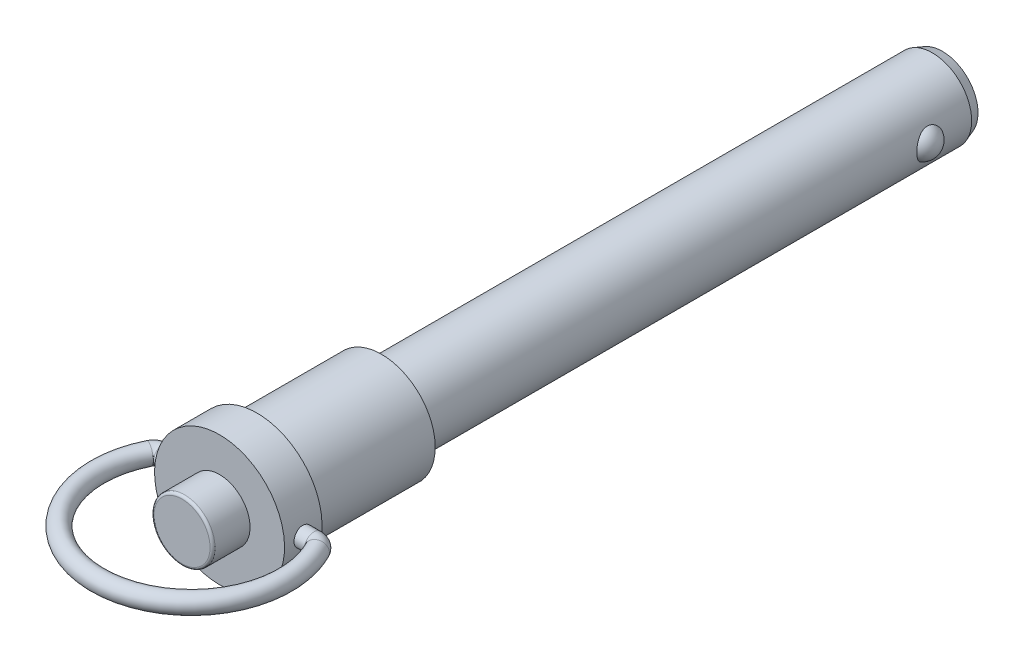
ISO-10303-21;
HEADER;
FILE_DESCRIPTION(('STEP AP214'),'2;1');
FILE_NAME('part.step','',(''),(''),'','','');
FILE_SCHEMA(('AUTOMOTIVE_DESIGN { 1 0 10303 214 1 1 1 1 }'));
ENDSEC;
DATA;
#1=APPLICATION_CONTEXT('core data for automotive mechanical design processes');
#2=APPLICATION_PROTOCOL_DEFINITION('international standard','automotive_design',2000,#1);
#3=PRODUCT_CONTEXT('',#1,'mechanical');
#4=PRODUCT('Part','Part','',(#3));
#5=PRODUCT_RELATED_PRODUCT_CATEGORY('part','',(#4));
#6=PRODUCT_DEFINITION_FORMATION('','',#4);
#7=PRODUCT_DEFINITION_CONTEXT('part definition',#1,'design');
#8=PRODUCT_DEFINITION('design','',#6,#7);
#9=PRODUCT_DEFINITION_SHAPE('','',#8);
#10=(LENGTH_UNIT() NAMED_UNIT(*) SI_UNIT(.MILLI.,.METRE.));
#11=(NAMED_UNIT(*) PLANE_ANGLE_UNIT() SI_UNIT($,.RADIAN.));
#12=(NAMED_UNIT(*) SI_UNIT($,.STERADIAN.) SOLID_ANGLE_UNIT());
#13=UNCERTAINTY_MEASURE_WITH_UNIT(LENGTH_MEASURE(1.E-05),#10,'distance_accuracy_value','');
#14=(GEOMETRIC_REPRESENTATION_CONTEXT(3) GLOBAL_UNCERTAINTY_ASSIGNED_CONTEXT((#13)) GLOBAL_UNIT_ASSIGNED_CONTEXT((#10,
#11,#12)) REPRESENTATION_CONTEXT('',''));
#15=CARTESIAN_POINT('',(0.,0.,0.));
#16=DIRECTION('',(0.,0.,1.));
#17=DIRECTION('',(1.,0.,0.));
#18=AXIS2_PLACEMENT_3D('',#15,#16,#17);
#19=CARTESIAN_POINT('',(-7.23283748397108,0.,-113.9826));
#20=DIRECTION('',(0.,0.,1.));
#21=DIRECTION('',(0.,1.,0.));
#22=AXIS2_PLACEMENT_3D('',#19,#20,#21);
#23=PLANE('',#22);
#24=CARTESIAN_POINT('',(0.,0.,-113.9826));
#25=DIRECTION('',(0.,0.,1.));
#26=DIRECTION('',(0.,1.,0.));
#27=AXIS2_PLACEMENT_3D('',#24,#25,#26);
#28=CIRCLE('',#27,7.23283748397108);
#29=CARTESIAN_POINT('',(0.,7.23283748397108,-113.9826));
#30=VERTEX_POINT('',#29);
#31=EDGE_CURVE('E210',#30,#30,#28,.T.);
#32=ORIENTED_EDGE('',*,*,#31,.F.);
#33=EDGE_LOOP('',(#32));
#34=FACE_BOUND('',#33,.T.);
#35=ADVANCED_FACE('F14',(#34),#23,.F.);
#36=CARTESIAN_POINT('',(6.3254,0.,-103.5178));
#37=DIRECTION('',(0.,0.,1.));
#38=DIRECTION('',(-1.,0.,0.));
#39=AXIS2_PLACEMENT_3D('',#36,#37,#38);
#40=SPHERICAL_SURFACE('',#39,3.175);
#41=CARTESIAN_POINT('',(7.972425,0.,-100.803406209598));
#42=CARTESIAN_POINT('',(7.97241726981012,0.174963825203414,-100.803411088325));
#43=CARTESIAN_POINT('',(7.96661031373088,0.350072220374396,-100.816853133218));
#44=CARTESIAN_POINT('',(7.94391651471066,0.695574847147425,-100.870541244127));
#45=CARTESIAN_POINT('',(7.92701418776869,0.865962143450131,-100.910824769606));
#46=CARTESIAN_POINT('',(7.88381094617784,1.19705751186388,-101.017849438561));
#47=CARTESIAN_POINT('',(7.85750751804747,1.35776298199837,-101.084597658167));
#48=CARTESIAN_POINT('',(7.79828591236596,1.66454963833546,-101.24375889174));
#49=CARTESIAN_POINT('',(7.76536929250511,1.81063425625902,-101.336165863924));
#50=CARTESIAN_POINT('',(7.6973220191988,2.08082133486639,-101.543431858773));
#51=CARTESIAN_POINT('',(7.6622476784,2.20529978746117,-101.657813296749));
#52=CARTESIAN_POINT('',(7.61082801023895,2.37452550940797,-101.845271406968));
#53=CARTESIAN_POINT('',(7.59387880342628,2.42804053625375,-101.910440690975));
#54=CARTESIAN_POINT('',(7.56094914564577,2.52871559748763,-102.045725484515));
#55=CARTESIAN_POINT('',(7.54496815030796,2.57587922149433,-102.115838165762));
#56=CARTESIAN_POINT('',(7.51569590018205,2.66002101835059,-102.255095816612));
#57=CARTESIAN_POINT('',(7.50229271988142,2.6974987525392,-102.323916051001));
#58=CARTESIAN_POINT('',(7.47725403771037,2.76614659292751,-102.46490445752));
#59=CARTESIAN_POINT('',(7.46561758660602,2.79732008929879,-102.537070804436));
#60=CARTESIAN_POINT('',(7.44451748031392,2.85299970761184,-102.684199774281));
#61=CARTESIAN_POINT('',(7.43505273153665,2.87750918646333,-102.759160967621));
#62=CARTESIAN_POINT('',(7.41863811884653,2.91956849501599,-102.911278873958));
#63=CARTESIAN_POINT('',(7.41168797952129,2.93711908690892,-102.988435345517));
#64=CARTESIAN_POINT('',(7.40116212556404,2.96353478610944,-103.13590466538));
#65=CARTESIAN_POINT('',(7.39730521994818,2.97312751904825,-103.206067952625));
#66=CARTESIAN_POINT('',(7.39192783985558,2.98647205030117,-103.347062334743));
#67=CARTESIAN_POINT('',(7.39040812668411,2.99022194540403,-103.417893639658));
#68=CARTESIAN_POINT('',(7.38975833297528,2.99182794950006,-103.559589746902));
#69=CARTESIAN_POINT('',(7.39062662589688,2.9896880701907,-103.630454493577));
#70=CARTESIAN_POINT('',(7.39471686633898,2.97955470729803,-103.771703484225));
#71=CARTESIAN_POINT('',(7.39793967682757,2.97155907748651,-103.84208754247));
#72=CARTESIAN_POINT('',(7.41052697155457,2.94009947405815,-104.043919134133));
#73=CARTESIAN_POINT('',(7.42280379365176,2.90920494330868,-104.1741115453));
#74=CARTESIAN_POINT('',(7.45413145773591,2.82795803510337,-104.427305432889));
#75=CARTESIAN_POINT('',(7.47318306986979,2.77760344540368,-104.550306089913));
#76=CARTESIAN_POINT('',(7.51696016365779,2.65690222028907,-104.790970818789));
#77=CARTESIAN_POINT('',(7.5418730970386,2.58587106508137,-104.908256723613));
#78=CARTESIAN_POINT('',(7.59450635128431,2.42693839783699,-105.130031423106));
#79=CARTESIAN_POINT('',(7.62222751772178,2.33903179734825,-105.234516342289));
#80=CARTESIAN_POINT('',(7.68069620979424,2.13967899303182,-105.438398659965));
#81=CARTESIAN_POINT('',(7.71148158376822,2.02679150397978,-105.53637565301));
#82=CARTESIAN_POINT('',(7.77061509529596,1.78672707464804,-105.71388153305));
#83=CARTESIAN_POINT('',(7.79896157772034,1.65954056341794,-105.793397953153));
#84=CARTESIAN_POINT('',(7.85313577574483,1.38188004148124,-105.939506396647));
#85=CARTESIAN_POINT('',(7.87849512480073,1.23034006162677,-106.004248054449));
#86=CARTESIAN_POINT('',(7.92093083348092,0.918236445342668,-106.109961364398));
#87=CARTESIAN_POINT('',(7.9380155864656,0.757682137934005,-106.150957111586));
#88=CARTESIAN_POINT('',(7.95754077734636,0.496793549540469,-106.197335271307));
#89=CARTESIAN_POINT('',(7.96310427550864,0.39798439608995,-106.210400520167));
#90=CARTESIAN_POINT('',(7.97054862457,0.199465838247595,-106.227831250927));
#91=CARTESIAN_POINT('',(7.97242940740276,0.0997564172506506,-106.232196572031));
#92=CARTESIAN_POINT('',(7.97241726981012,-0.174963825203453,-106.232188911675));
#93=CARTESIAN_POINT('',(7.96661031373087,-0.350072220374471,-106.218746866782));
#94=CARTESIAN_POINT('',(7.94391651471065,-0.695574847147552,-106.165058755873));
#95=CARTESIAN_POINT('',(7.92701418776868,-0.865962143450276,-106.124775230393));
#96=CARTESIAN_POINT('',(7.88381094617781,-1.19705751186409,-106.017750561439));
#97=CARTESIAN_POINT('',(7.85750751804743,-1.35776298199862,-105.951002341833));
#98=CARTESIAN_POINT('',(7.7982859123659,-1.66454963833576,-105.79184110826));
#99=CARTESIAN_POINT('',(7.76536929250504,-1.81063425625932,-105.699434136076));
#100=CARTESIAN_POINT('',(7.69732201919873,-2.08082133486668,-105.492168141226));
#101=CARTESIAN_POINT('',(7.66224767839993,-2.20529978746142,-105.377786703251));
#102=CARTESIAN_POINT('',(7.61082801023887,-2.37452550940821,-105.190328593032));
#103=CARTESIAN_POINT('',(7.59387880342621,-2.428040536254,-105.125159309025));
#104=CARTESIAN_POINT('',(7.5609491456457,-2.52871559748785,-104.989874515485));
#105=CARTESIAN_POINT('',(7.54496815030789,-2.57587922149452,-104.919761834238));
#106=CARTESIAN_POINT('',(7.51569590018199,-2.66002101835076,-104.780504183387));
#107=CARTESIAN_POINT('',(7.50229271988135,-2.69749875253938,-104.711683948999));
#108=CARTESIAN_POINT('',(7.47725403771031,-2.76614659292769,-104.57069554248));
#109=CARTESIAN_POINT('',(7.46561758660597,-2.79732008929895,-104.498529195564));
#110=CARTESIAN_POINT('',(7.44451748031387,-2.85299970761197,-104.351400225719));
#111=CARTESIAN_POINT('',(7.4350527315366,-2.87750918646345,-104.276439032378));
#112=CARTESIAN_POINT('',(7.4186381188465,-2.91956849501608,-104.124321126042));
#113=CARTESIAN_POINT('',(7.41168797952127,-2.93711908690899,-104.047164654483));
#114=CARTESIAN_POINT('',(7.40116212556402,-2.96353478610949,-103.89969533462));
#115=CARTESIAN_POINT('',(7.39730521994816,-2.97312751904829,-103.829532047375));
#116=CARTESIAN_POINT('',(7.39192783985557,-2.9864720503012,-103.688537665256));
#117=CARTESIAN_POINT('',(7.3904081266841,-2.99022194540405,-103.617706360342));
#118=CARTESIAN_POINT('',(7.38975833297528,-2.99182794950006,-103.476010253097));
#119=CARTESIAN_POINT('',(7.39062662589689,-2.98968807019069,-103.405145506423));
#120=CARTESIAN_POINT('',(7.39471686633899,-2.979554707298,-103.263896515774));
#121=CARTESIAN_POINT('',(7.39793967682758,-2.97155907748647,-103.193512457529));
#122=CARTESIAN_POINT('',(7.41052697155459,-2.9400994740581,-102.991680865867));
#123=CARTESIAN_POINT('',(7.42280379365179,-2.90920494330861,-102.8614884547));
#124=CARTESIAN_POINT('',(7.45413145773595,-2.82795803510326,-102.608294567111));
#125=CARTESIAN_POINT('',(7.47318306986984,-2.77760344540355,-102.485293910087));
#126=CARTESIAN_POINT('',(7.51696016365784,-2.65690222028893,-102.24462918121));
#127=CARTESIAN_POINT('',(7.54187309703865,-2.58587106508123,-102.127343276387));
#128=CARTESIAN_POINT('',(7.59450635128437,-2.42693839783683,-101.905568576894));
#129=CARTESIAN_POINT('',(7.62222751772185,-2.33903179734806,-101.801083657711));
#130=CARTESIAN_POINT('',(7.68069620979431,-2.13967899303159,-101.597201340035));
#131=CARTESIAN_POINT('',(7.71148158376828,-2.02679150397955,-101.49922434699));
#132=CARTESIAN_POINT('',(7.77061509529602,-1.78672707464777,-101.32171846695));
#133=CARTESIAN_POINT('',(7.7989615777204,-1.65954056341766,-101.242202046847));
#134=CARTESIAN_POINT('',(7.85313577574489,-1.38188004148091,-101.096093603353));
#135=CARTESIAN_POINT('',(7.87849512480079,-1.23034006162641,-101.031351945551));
#136=CARTESIAN_POINT('',(7.92093083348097,-0.918236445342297,-100.925638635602));
#137=CARTESIAN_POINT('',(7.93801558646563,-0.757682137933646,-100.884642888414));
#138=CARTESIAN_POINT('',(7.95754077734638,-0.496793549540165,-100.838264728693));
#139=CARTESIAN_POINT('',(7.96310427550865,-0.397984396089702,-100.825199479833));
#140=CARTESIAN_POINT('',(7.97054862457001,-0.199465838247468,-100.807768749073));
#141=CARTESIAN_POINT('',(7.97242940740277,-0.0997564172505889,-100.803403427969));
#142=CARTESIAN_POINT('',(7.972425,0.,-100.803406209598));
#143=B_SPLINE_CURVE_WITH_KNOTS('',3,(#41,#42,#43,#44,#45,#46,#47,#48,#49,#50,#51,#52,#53,#54,
#55,#56,#57,#58,#59,#60,#61,#62,#63,#64,#65,#66,#67,#68,#69,#70,#71,#72,#73,#74,#75,#76,#77,#78,
#79,#80,#81,#82,#83,#84,#85,#86,#87,#88,#89,#90,#91,#92,#93,#94,#95,#96,#97,#98,#99,#100,#101,
#102,#103,#104,#105,#106,#107,#108,#109,#110,#111,#112,#113,#114,#115,#116,#117,#118,#119,#120,
#121,#122,#123,#124,#125,#126,#127,#128,#129,#130,#131,#132,#133,#134,#135,#136,#137,#138,#139,
#140,#141,#142),.UNSPECIFIED.,.T.,.F.,(4,2,2,2,2,2,2,2,2,2,2,2,2,2,2,2,2,2,2,2,2,2,2,2,2,2,2,2,
2,2,2,2,2,2,2,2,2,2,2,2,2,2,2,2,2,2,2,2,2,2,4),(0.,0.52453249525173,1.04979855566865,
1.57520515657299,2.10048814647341,2.61543479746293,2.87315909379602,3.13073711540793,
3.36891793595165,3.60697032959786,3.84490258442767,4.08280877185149,4.29529683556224,
4.5078540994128,4.72026662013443,4.93275703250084,5.33386765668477,5.73502389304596,
6.15136290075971,6.56782764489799,7.02375816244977,7.47999569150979,7.97801301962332,
8.47552411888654,8.77458316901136,9.07364774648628,9.59818024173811,10.1234463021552,
10.6488529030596,11.17413589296,11.6890825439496,11.9468068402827,12.2043848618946,
12.4425656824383,12.6806180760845,12.9185503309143,13.1564565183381,13.3689445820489,
13.5815018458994,13.7939143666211,14.0064047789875,14.4075154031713,14.8086716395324,
15.2250106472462,15.6414753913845,16.0974059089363,16.5536434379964,17.05166076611,
17.5491718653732,17.8482309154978,18.1472954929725),.UNSPECIFIED.);
#144=CARTESIAN_POINT('',(7.972425,0.,-100.803406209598));
#145=VERTEX_POINT('',#144);
#146=EDGE_CURVE('E170',#145,#145,#143,.T.);
#147=ORIENTED_EDGE('',*,*,#146,.F.);
#148=EDGE_LOOP('',(#147));
#149=FACE_BOUND('',#148,.T.);
#150=ADVANCED_FACE('F143',(#149),#40,.T.);
#151=CARTESIAN_POINT('',(-6.3246,0.,-103.5178));
#152=DIRECTION('',(0.,0.,1.));
#153=DIRECTION('',(-1.,0.,0.));
#154=AXIS2_PLACEMENT_3D('',#151,#152,#153);
#155=SPHERICAL_SURFACE('',#154,3.175);
#156=CARTESIAN_POINT('',(-7.972425,0.,-106.23170820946));
#157=CARTESIAN_POINT('',(-7.97241727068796,0.174952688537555,-106.231703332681));
#158=CARTESIAN_POINT('',(-7.96661105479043,0.350049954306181,-106.218262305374));
#159=CARTESIAN_POINT('',(-7.94392013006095,0.695530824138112,-106.164578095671));
#160=CARTESIAN_POINT('',(-7.92701993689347,0.865907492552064,-106.124297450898));
#161=CARTESIAN_POINT('',(-7.88382210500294,1.19698257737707,-106.017279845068));
#162=CARTESIAN_POINT('',(-7.85752194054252,1.357678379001,-105.950535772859));
#163=CARTESIAN_POINT('',(-7.79830777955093,1.66444625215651,-105.791383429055));
#164=CARTESIAN_POINT('',(-7.76539534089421,1.81052175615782,-105.698981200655));
#165=CARTESIAN_POINT('',(-7.69735815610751,2.08068673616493,-105.491727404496));
#166=CARTESIAN_POINT('',(-7.66228978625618,2.20515274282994,-105.377354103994));
#167=CARTESIAN_POINT('',(-7.61087967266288,2.37435974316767,-105.189908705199));
#168=CARTESIAN_POINT('',(-7.593933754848,2.42786851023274,-105.124743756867));
#169=CARTESIAN_POINT('',(-7.56101087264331,2.52853087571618,-104.989467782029));
#170=CARTESIAN_POINT('',(-7.54503336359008,2.57568806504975,-104.919359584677));
#171=CARTESIAN_POINT('',(-7.51576908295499,2.65981407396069,-104.780115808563));
#172=CARTESIAN_POINT('',(-7.5023702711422,2.69728292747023,-104.711305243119));
#173=CARTESIAN_POINT('',(-7.47734019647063,2.7659135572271,-104.570336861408));
#174=CARTESIAN_POINT('',(-7.46570798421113,2.79707872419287,-104.498180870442));
#175=CARTESIAN_POINT('',(-7.44461613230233,2.85274218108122,-104.351073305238));
#176=CARTESIAN_POINT('',(-7.43515539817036,2.87724383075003,-104.276123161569));
#177=CARTESIAN_POINT('',(-7.41874848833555,2.91928796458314,-104.124028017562));
#178=CARTESIAN_POINT('',(-7.41180203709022,2.93683121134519,-104.046883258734));
#179=CARTESIAN_POINT('',(-7.40128307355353,2.96323267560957,-103.899441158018));
#180=CARTESIAN_POINT('',(-7.39742927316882,2.97281883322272,-103.829293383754));
#181=CARTESIAN_POINT('',(-7.3920573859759,2.98615137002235,-103.688330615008));
#182=CARTESIAN_POINT('',(-7.39054006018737,2.98989584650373,-103.617515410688));
#183=CARTESIAN_POINT('',(-7.38989424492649,2.99149222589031,-103.47585196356));
#184=CARTESIAN_POINT('',(-7.39076412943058,2.98934813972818,-103.405003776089));
#185=CARTESIAN_POINT('',(-7.39485671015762,2.97920762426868,-103.263788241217));
#186=CARTESIAN_POINT('',(-7.39808026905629,2.97120904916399,-103.193421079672));
#187=CARTESIAN_POINT('',(-7.41066840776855,2.9397429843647,-102.991639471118));
#188=CARTESIAN_POINT('',(-7.42294415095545,2.9088467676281,-102.86148039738));
#189=CARTESIAN_POINT('',(-7.45426659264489,2.82760178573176,-102.608352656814));
#190=CARTESIAN_POINT('',(-7.47331406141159,2.77725080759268,-102.485384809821));
#191=CARTESIAN_POINT('',(-7.51708080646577,2.6565607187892,-102.244781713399));
#192=CARTESIAN_POINT('',(-7.5419875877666,2.58553675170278,-102.127524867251));
#193=CARTESIAN_POINT('',(-7.59460690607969,2.42662332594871,-101.905805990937));
#194=CARTESIAN_POINT('',(-7.62232028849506,2.33872877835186,-101.80134783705));
#195=CARTESIAN_POINT('',(-7.68077324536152,2.13940178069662,-101.597513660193));
#196=CARTESIAN_POINT('',(-7.71155061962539,2.02652778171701,-101.499558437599));
#197=CARTESIAN_POINT('',(-7.77066832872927,1.78649437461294,-101.322092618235));
#198=CARTESIAN_POINT('',(-7.79900700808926,1.65932539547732,-101.242594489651));
#199=CARTESIAN_POINT('',(-7.85316757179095,1.38169777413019,-101.096515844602));
#200=CARTESIAN_POINT('',(-7.87852090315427,1.23017281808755,-101.031786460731));
#201=CARTESIAN_POINT('',(-7.92094613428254,0.91810159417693,-100.926094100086));
#202=CARTESIAN_POINT('',(-7.93802642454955,0.757564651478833,-100.885107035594));
#203=CARTESIAN_POINT('',(-7.95754577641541,0.496710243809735,-100.838740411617));
#204=CARTESIAN_POINT('',(-7.96310740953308,0.397917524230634,-100.825678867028));
#205=CARTESIAN_POINT('',(-7.97054925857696,0.199432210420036,-100.808253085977));
#206=CARTESIAN_POINT('',(-7.97242940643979,0.0997395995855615,-100.803889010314));
#207=CARTESIAN_POINT('',(-7.97241727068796,-0.17495268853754,-100.803896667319));
#208=CARTESIAN_POINT('',(-7.96661105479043,-0.350049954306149,-100.817337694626));
#209=CARTESIAN_POINT('',(-7.94392013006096,-0.695530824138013,-100.871021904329));
#210=CARTESIAN_POINT('',(-7.92701993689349,-0.865907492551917,-100.911302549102));
#211=CARTESIAN_POINT('',(-7.88382210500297,-1.1969825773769,-101.018320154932));
#212=CARTESIAN_POINT('',(-7.85752194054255,-1.35767837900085,-101.085064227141));
#213=CARTESIAN_POINT('',(-7.79830777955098,-1.66444625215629,-101.244216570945));
#214=CARTESIAN_POINT('',(-7.76539534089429,-1.81052175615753,-101.336618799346));
#215=CARTESIAN_POINT('',(-7.6973581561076,-2.08068673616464,-101.543872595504));
#216=CARTESIAN_POINT('',(-7.66228978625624,-2.20515274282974,-101.658245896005));
#217=CARTESIAN_POINT('',(-7.61087967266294,-2.37435974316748,-101.845691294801));
#218=CARTESIAN_POINT('',(-7.59393375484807,-2.42786851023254,-101.910856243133));
#219=CARTESIAN_POINT('',(-7.56101087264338,-2.52853087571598,-102.04613221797));
#220=CARTESIAN_POINT('',(-7.54503336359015,-2.57568806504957,-102.116240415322));
#221=CARTESIAN_POINT('',(-7.51576908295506,-2.65981407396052,-102.255484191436));
#222=CARTESIAN_POINT('',(-7.50237027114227,-2.69728292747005,-102.324294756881));
#223=CARTESIAN_POINT('',(-7.4773401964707,-2.76591355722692,-102.465263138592));
#224=CARTESIAN_POINT('',(-7.4657079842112,-2.79707872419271,-102.537419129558));
#225=CARTESIAN_POINT('',(-7.44461613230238,-2.85274218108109,-102.684526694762));
#226=CARTESIAN_POINT('',(-7.4351553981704,-2.87724383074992,-102.759476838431));
#227=CARTESIAN_POINT('',(-7.41874848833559,-2.91928796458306,-102.911571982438));
#228=CARTESIAN_POINT('',(-7.41180203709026,-2.93683121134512,-102.988716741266));
#229=CARTESIAN_POINT('',(-7.40128307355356,-2.96323267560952,-103.136158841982));
#230=CARTESIAN_POINT('',(-7.39742927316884,-2.97281883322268,-103.206306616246));
#231=CARTESIAN_POINT('',(-7.3920573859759,-2.98615137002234,-103.347269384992));
#232=CARTESIAN_POINT('',(-7.39054006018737,-2.98989584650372,-103.418084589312));
#233=CARTESIAN_POINT('',(-7.38989424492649,-2.99149222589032,-103.55974803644));
#234=CARTESIAN_POINT('',(-7.39076412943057,-2.98934813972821,-103.630596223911));
#235=CARTESIAN_POINT('',(-7.39485671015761,-2.97920762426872,-103.771811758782));
#236=CARTESIAN_POINT('',(-7.39808026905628,-2.97120904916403,-103.842178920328));
#237=CARTESIAN_POINT('',(-7.41066840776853,-2.93974298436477,-104.043960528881));
#238=CARTESIAN_POINT('',(-7.42294415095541,-2.90884676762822,-104.174119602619));
#239=CARTESIAN_POINT('',(-7.45426659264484,-2.82760178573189,-104.427247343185));
#240=CARTESIAN_POINT('',(-7.47331406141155,-2.7772508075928,-104.550215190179));
#241=CARTESIAN_POINT('',(-7.51708080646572,-2.65656071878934,-104.7908182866));
#242=CARTESIAN_POINT('',(-7.54198758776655,-2.58553675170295,-104.908075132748));
#243=CARTESIAN_POINT('',(-7.59460690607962,-2.42662332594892,-105.129794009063));
#244=CARTESIAN_POINT('',(-7.62232028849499,-2.33872877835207,-105.23425216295));
#245=CARTESIAN_POINT('',(-7.68077324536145,-2.13940178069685,-105.438086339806));
#246=CARTESIAN_POINT('',(-7.71155061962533,-2.02652778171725,-105.5360415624));
#247=CARTESIAN_POINT('',(-7.77066832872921,-1.78649437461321,-105.713507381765));
#248=CARTESIAN_POINT('',(-7.7990070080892,-1.6593253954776,-105.793005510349));
#249=CARTESIAN_POINT('',(-7.85316757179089,-1.38169777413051,-105.939084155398));
#250=CARTESIAN_POINT('',(-7.87852090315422,-1.2301728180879,-106.003813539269));
#251=CARTESIAN_POINT('',(-7.9209461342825,-0.9181015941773,-106.109505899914));
#252=CARTESIAN_POINT('',(-7.93802642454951,-0.757564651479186,-106.150492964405));
#253=CARTESIAN_POINT('',(-7.95754577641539,-0.49671024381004,-106.196859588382));
#254=CARTESIAN_POINT('',(-7.96310740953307,-0.397917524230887,-106.209921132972));
#255=CARTESIAN_POINT('',(-7.97054925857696,-0.199432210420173,-106.227346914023));
#256=CARTESIAN_POINT('',(-7.97242940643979,-0.0997395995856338,-106.231710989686));
#257=CARTESIAN_POINT('',(-7.972425,0.,-106.23170820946));
#258=B_SPLINE_CURVE_WITH_KNOTS('',3,(#156,#157,#158,#159,#160,#161,#162,#163,#164,#165,#166,
#167,#168,#169,#170,#171,#172,#173,#174,#175,#176,#177,#178,#179,#180,#181,#182,#183,#184,#185,
#186,#187,#188,#189,#190,#191,#192,#193,#194,#195,#196,#197,#198,#199,#200,#201,#202,#203,#204,
#205,#206,#207,#208,#209,#210,#211,#212,#213,#214,#215,#216,#217,#218,#219,#220,#221,#222,#223,
#224,#225,#226,#227,#228,#229,#230,#231,#232,#233,#234,#235,#236,#237,#238,#239,#240,#241,#242,
#243,#244,#245,#246,#247,#248,#249,#250,#251,#252,#253,#254,#255,#256,#257),.UNSPECIFIED.,.T.,
.F.,(4,2,2,2,2,2,2,2,2,2,2,2,2,2,2,2,2,2,2,2,2,2,2,2,2,2,2,2,2,2,2,2,2,2,2,2,2,2,2,2,2,2,2,2,2,
2,2,2,2,2,4),(0.,0.524499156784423,1.04973194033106,1.57510595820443,2.10035634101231,
2.61525617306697,2.87295695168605,3.13051142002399,3.36865238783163,3.60666491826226,
3.84455721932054,4.08242344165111,4.2948623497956,4.50737043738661,4.71973381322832,
4.93217506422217,5.33319020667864,5.73425097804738,6.15050279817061,6.56688037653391,
7.02273464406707,7.47889596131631,7.97685568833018,8.47430932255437,8.77331798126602,
9.0723321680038,9.59683132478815,10.1220641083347,10.647438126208,11.1726885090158,
11.6875883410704,11.9452891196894,12.2028435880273,12.440984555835,12.6789970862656,
12.9168893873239,13.1547556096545,13.367194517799,13.57970260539,13.7920659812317,
14.0045072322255,14.405522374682,14.8065831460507,15.222834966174,15.6392125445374,
16.0950668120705,16.5512281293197,17.0491878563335,17.5466414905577,17.8456501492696,
18.1446643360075),.UNSPECIFIED.);
#259=CARTESIAN_POINT('',(-7.972425,0.,-106.23170820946));
#260=VERTEX_POINT('',#259);
#261=EDGE_CURVE('E25',#260,#260,#258,.T.);
#262=ORIENTED_EDGE('',*,*,#261,.F.);
#263=EDGE_LOOP('',(#262));
#264=FACE_BOUND('',#263,.T.);
#265=ADVANCED_FACE('F149',(#264),#155,.T.);
#266=CARTESIAN_POINT('',(0.,0.,-111.9506));
#267=DIRECTION('',(0.,0.,1.));
#268=DIRECTION('',(0.,1.,0.));
#269=AXIS2_PLACEMENT_3D('',#266,#267,#268);
#270=CONICAL_SURFACE('',#269,7.972425,0.349065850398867);
#271=CARTESIAN_POINT('',(0.,0.,-111.9506));
#272=DIRECTION('',(0.,0.,1.));
#273=DIRECTION('',(0.,1.,0.));
#274=AXIS2_PLACEMENT_3D('',#271,#272,#273);
#275=CIRCLE('',#274,7.972425);
#276=CARTESIAN_POINT('',(0.,7.972425,-111.9506));
#277=VERTEX_POINT('',#276);
#278=EDGE_CURVE('E9',#277,#277,#275,.T.);
#279=ORIENTED_EDGE('',*,*,#278,.F.);
#280=EDGE_LOOP('',(#279));
#281=FACE_BOUND('',#280,.T.);
#282=ORIENTED_EDGE('',*,*,#31,.T.);
#283=EDGE_LOOP('',(#282));
#284=FACE_BOUND('',#283,.T.);
#285=ADVANCED_FACE('F177',(#281,#284),#270,.T.);
#286=CARTESIAN_POINT('',(0.,0.,-50.));
#287=DIRECTION('',(0.,0.,1.));
#288=DIRECTION('',(0.810321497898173,0.585985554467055,0.));
#289=AXIS2_PLACEMENT_3D('',#286,#287,#288);
#290=CYLINDRICAL_SURFACE('',#289,7.972425);
#291=CARTESIAN_POINT('',(0.,0.,0.));
#292=DIRECTION('',(0.,0.,-1.));
#293=DIRECTION('',(0.,1.,0.));
#294=AXIS2_PLACEMENT_3D('',#291,#292,#293);
#295=CIRCLE('',#294,7.972425);
#296=CARTESIAN_POINT('',(0.,7.972425,0.));
#297=VERTEX_POINT('',#296);
#298=EDGE_CURVE('E162',#297,#297,#295,.T.);
#299=ORIENTED_EDGE('',*,*,#298,.T.);
#300=EDGE_LOOP('',(#299));
#301=FACE_BOUND('',#300,.T.);
#302=ORIENTED_EDGE('',*,*,#278,.T.);
#303=EDGE_LOOP('',(#302));
#304=FACE_BOUND('',#303,.T.);
#305=ORIENTED_EDGE('',*,*,#261,.T.);
#306=EDGE_LOOP('',(#305));
#307=FACE_BOUND('',#306,.T.);
#308=ORIENTED_EDGE('',*,*,#146,.T.);
#309=EDGE_LOOP('',(#308));
#310=FACE_BOUND('',#309,.T.);
#311=ADVANCED_FACE('F63',(#301,#304,#307,#310),#290,.T.);
#312=CARTESIAN_POINT('',(0.,0.,40.545));
#313=DIRECTION('',(0.,0.,1.));
#314=DIRECTION('',(0.,1.,0.));
#315=AXIS2_PLACEMENT_3D('',#312,#313,#314);
#316=PLANE('',#315);
#317=CARTESIAN_POINT('',(0.,0.,40.545));
#318=DIRECTION('',(0.,0.,-1.));
#319=DIRECTION('',(0.,-1.,0.));
#320=AXIS2_PLACEMENT_3D('',#317,#318,#319);
#321=CIRCLE('',#320,5.6896);
#322=CARTESIAN_POINT('',(0.,-5.6896,40.545));
#323=VERTEX_POINT('',#322);
#324=CARTESIAN_POINT('',(0.,5.6896,40.545));
#325=VERTEX_POINT('',#324);
#326=EDGE_CURVE('E38',#323,#325,#321,.T.);
#327=ORIENTED_EDGE('',*,*,#326,.F.);
#328=CARTESIAN_POINT('',(0.,0.,40.545));
#329=DIRECTION('',(0.,0.,-1.));
#330=DIRECTION('',(0.,1.,0.));
#331=AXIS2_PLACEMENT_3D('',#328,#329,#330);
#332=CIRCLE('',#331,5.6896);
#333=EDGE_CURVE('E32',#325,#323,#332,.T.);
#334=ORIENTED_EDGE('',*,*,#333,.F.);
#335=EDGE_LOOP('',(#327,#334));
#336=FACE_BOUND('',#335,.T.);
#337=ADVANCED_FACE('F43',(#336),#316,.T.);
#338=CARTESIAN_POINT('',(0.,0.,38.64));
#339=DIRECTION('',(0.,1.,0.));
#340=DIRECTION('',(-1.,0.,0.));
#341=AXIS2_PLACEMENT_3D('',#338,#339,#340);
#342=TOROIDAL_SURFACE('',#341,19.05,1.8796);
#343=CARTESIAN_POINT('',(-17.0651122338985,0.,30.1733333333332));
#344=DIRECTION('',(-0.44444444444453,0.,0.895806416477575));
#345=DIRECTION('',(-0.895806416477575,0.,-0.44444444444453));
#346=AXIS2_PLACEMENT_3D('',#343,#344,#345);
#347=CIRCLE('',#346,1.8796);
#348=CARTESIAN_POINT('',(-18.7488699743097,0.,29.3379555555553));
#349=VERTEX_POINT('',#348);
#350=EDGE_CURVE('E108',#349,#349,#347,.F.);
#351=ORIENTED_EDGE('',*,*,#350,.F.);
#352=EDGE_LOOP('',(#351));
#353=FACE_BOUND('',#352,.T.);
#354=CARTESIAN_POINT('',(17.0651122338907,0.,30.1733333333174));
#355=DIRECTION('',(-0.444444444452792,0.,-0.895806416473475));
#356=DIRECTION('',(0.895806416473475,0.,-0.444444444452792));
#357=AXIS2_PLACEMENT_3D('',#354,#355,#356);
#358=CIRCLE('',#357,1.8796);
#359=CARTESIAN_POINT('',(18.7488699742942,0.,29.3379555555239));
#360=VERTEX_POINT('',#359);
#361=EDGE_CURVE('E105',#360,#360,#358,.T.);
#362=ORIENTED_EDGE('',*,*,#361,.F.);
#363=EDGE_LOOP('',(#362));
#364=FACE_BOUND('',#363,.T.);
#365=ADVANCED_FACE('F62',(#353,#364),#342,.T.);
#366=CARTESIAN_POINT('',(0.,0.,40.037));
#367=DIRECTION('',(0.,0.,1.));
#368=DIRECTION('',(0.,1.,0.));
#369=AXIS2_PLACEMENT_3D('',#366,#367,#368);
#370=TOROIDAL_SURFACE('',#369,5.6896,0.508);
#371=ORIENTED_EDGE('',*,*,#333,.T.);
#372=ORIENTED_EDGE('',*,*,#326,.T.);
#373=EDGE_LOOP('',(#371,#372));
#374=FACE_BOUND('',#373,.T.);
#375=CARTESIAN_POINT('',(0.,0.,40.037));
#376=DIRECTION('',(0.,0.,-1.));
#377=DIRECTION('',(0.,-1.,0.));
#378=AXIS2_PLACEMENT_3D('',#375,#376,#377);
#379=CIRCLE('',#378,6.1976);
#380=CARTESIAN_POINT('',(0.,-6.1976,40.037));
#381=VERTEX_POINT('',#380);
#382=EDGE_CURVE('E82',#381,#381,#379,.T.);
#383=ORIENTED_EDGE('',*,*,#382,.F.);
#384=EDGE_LOOP('',(#383));
#385=FACE_BOUND('',#384,.T.);
#386=ADVANCED_FACE('F36',(#374,#385),#370,.T.);
#387=CARTESIAN_POINT('',(-15.3586010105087,0.,31.02));
#388=DIRECTION('',(0.,1.,0.));
#389=DIRECTION('',(-1.,0.,0.));
#390=AXIS2_PLACEMENT_3D('',#387,#388,#389);
#391=TOROIDAL_SURFACE('',#390,1.905,1.8796);
#392=CARTESIAN_POINT('',(-15.3586010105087,0.,29.115));
#393=DIRECTION('',(1.,0.,0.));
#394=DIRECTION('',(0.,0.,-1.));
#395=AXIS2_PLACEMENT_3D('',#392,#393,#394);
#396=CIRCLE('',#395,1.8796);
#397=CARTESIAN_POINT('',(-15.3586010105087,0.,27.2354));
#398=VERTEX_POINT('',#397);
#399=EDGE_CURVE('E40',#398,#398,#396,.T.);
#400=ORIENTED_EDGE('',*,*,#399,.F.);
#401=EDGE_LOOP('',(#400));
#402=FACE_BOUND('',#401,.T.);
#403=ORIENTED_EDGE('',*,*,#350,.T.);
#404=EDGE_LOOP('',(#403));
#405=FACE_BOUND('',#404,.T.);
#406=ADVANCED_FACE('F65',(#402,#405),#391,.T.);
#407=CARTESIAN_POINT('',(15.3586010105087,0.,31.02));
#408=DIRECTION('',(0.,1.,0.));
#409=DIRECTION('',(-1.,0.,0.));
#410=AXIS2_PLACEMENT_3D('',#407,#408,#409);
#411=TOROIDAL_SURFACE('',#410,1.90500000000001,1.8796);
#412=CARTESIAN_POINT('',(15.3586010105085,0.,29.115));
#413=DIRECTION('',(1.,0.,0.));
#414=DIRECTION('',(0.,0.,-1.));
#415=AXIS2_PLACEMENT_3D('',#412,#413,#414);
#416=CIRCLE('',#415,1.8796);
#417=CARTESIAN_POINT('',(15.3586010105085,0.,27.2354));
#418=VERTEX_POINT('',#417);
#419=EDGE_CURVE('E44',#418,#418,#416,.F.);
#420=ORIENTED_EDGE('',*,*,#419,.F.);
#421=EDGE_LOOP('',(#420));
#422=FACE_BOUND('',#421,.T.);
#423=ORIENTED_EDGE('',*,*,#361,.T.);
#424=EDGE_LOOP('',(#423));
#425=FACE_BOUND('',#424,.T.);
#426=ADVANCED_FACE('F67',(#422,#425),#411,.T.);
#427=CARTESIAN_POINT('',(0.,0.,40.545));
#428=DIRECTION('',(0.,0.,-1.));
#429=DIRECTION('',(0.,-1.,0.));
#430=AXIS2_PLACEMENT_3D('',#427,#428,#429);
#431=CYLINDRICAL_SURFACE('',#430,6.1976);
#432=CARTESIAN_POINT('',(0.,0.,32.925));
#433=DIRECTION('',(0.,0.,-1.));
#434=DIRECTION('',(0.,-1.,0.));
#435=AXIS2_PLACEMENT_3D('',#432,#433,#434);
#436=CIRCLE('',#435,6.1976);
#437=CARTESIAN_POINT('',(0.,-6.1976,32.925));
#438=VERTEX_POINT('',#437);
#439=EDGE_CURVE('E118',#438,#438,#436,.T.);
#440=ORIENTED_EDGE('',*,*,#439,.F.);
#441=EDGE_LOOP('',(#440));
#442=FACE_BOUND('',#441,.T.);
#443=ORIENTED_EDGE('',*,*,#382,.T.);
#444=EDGE_LOOP('',(#443));
#445=FACE_BOUND('',#444,.T.);
#446=ADVANCED_FACE('F87',(#442,#445),#431,.T.);
#447=CARTESIAN_POINT('',(-15.3586010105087,0.,29.115));
#448=DIRECTION('',(1.,0.,0.));
#449=DIRECTION('',(0.,0.,-1.));
#450=AXIS2_PLACEMENT_3D('',#447,#448,#449);
#451=CYLINDRICAL_SURFACE('',#450,1.8796);
#452=CARTESIAN_POINT('',(-13.208,0.,27.2354));
#453=CARTESIAN_POINT('',(-13.2079983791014,0.105008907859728,27.235404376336));
#454=CARTESIAN_POINT('',(-13.2067345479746,0.210080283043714,27.2442296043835));
#455=CARTESIAN_POINT('',(-13.2018144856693,0.41729041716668,27.2792908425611));
#456=CARTESIAN_POINT('',(-13.1981558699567,0.519426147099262,27.3055442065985));
#457=CARTESIAN_POINT('',(-13.1888577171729,0.7177359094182,27.3746649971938));
#458=CARTESIAN_POINT('',(-13.1832196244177,0.813914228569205,27.4175203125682));
#459=CARTESIAN_POINT('',(-13.1705868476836,0.99769843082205,27.5185998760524));
#460=CARTESIAN_POINT('',(-13.1635923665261,1.08530559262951,27.5768218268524));
#461=CARTESIAN_POINT('',(-13.1489704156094,1.25009506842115,27.7074204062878));
#462=CARTESIAN_POINT('',(-13.1413392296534,1.32720810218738,27.7798840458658));
#463=CARTESIAN_POINT('',(-13.1263333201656,1.46822296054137,27.9367218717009));
#464=CARTESIAN_POINT('',(-13.1189586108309,1.5321240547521,28.0210967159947));
#465=CARTESIAN_POINT('',(-13.1052644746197,1.6451672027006,28.1998226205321));
#466=CARTESIAN_POINT('',(-13.0989498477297,1.69424288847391,28.2942160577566));
#467=CARTESIAN_POINT('',(-13.088141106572,1.77581811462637,28.490010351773));
#468=CARTESIAN_POINT('',(-13.0836469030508,1.80831846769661,28.5914108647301));
#469=CARTESIAN_POINT('',(-13.0770241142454,1.85560673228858,28.7976151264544));
#470=CARTESIAN_POINT('',(-13.0748797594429,1.87051276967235,28.9023912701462));
#471=CARTESIAN_POINT('',(-13.0731514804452,1.88255508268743,29.1129780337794));
#472=CARTESIAN_POINT('',(-13.0735674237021,1.87969227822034,29.2187885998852));
#473=CARTESIAN_POINT('',(-13.0768983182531,1.85637484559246,29.4276098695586));
#474=CARTESIAN_POINT('',(-13.07979464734,1.8360513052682,29.5306355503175));
#475=CARTESIAN_POINT('',(-13.0877308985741,1.77859429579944,29.7317993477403));
#476=CARTESIAN_POINT('',(-13.0927708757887,1.74146039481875,29.8299373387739));
#477=CARTESIAN_POINT('',(-13.1044472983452,1.65129893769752,30.0189415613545));
#478=CARTESIAN_POINT('',(-13.1110893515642,1.59821538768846,30.1097807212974));
#479=CARTESIAN_POINT('',(-13.1252173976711,1.47770141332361,30.281311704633));
#480=CARTESIAN_POINT('',(-13.1327034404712,1.4102701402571,30.3620029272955));
#481=CARTESIAN_POINT('',(-13.1477584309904,1.26225301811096,30.5117076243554));
#482=CARTESIAN_POINT('',(-13.1553275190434,1.18155436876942,30.5806096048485));
#483=CARTESIAN_POINT('',(-13.1696331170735,1.00967896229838,30.7039085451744));
#484=CARTESIAN_POINT('',(-13.1763696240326,0.918502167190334,30.7583054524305));
#485=CARTESIAN_POINT('',(-13.1882570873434,0.728165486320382,30.8510539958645));
#486=CARTESIAN_POINT('',(-13.1934072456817,0.62900161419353,30.8893975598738));
#487=CARTESIAN_POINT('',(-13.2015349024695,0.425552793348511,30.9488568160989));
#488=CARTESIAN_POINT('',(-13.2045125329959,0.321268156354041,30.969973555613));
#489=CARTESIAN_POINT('',(-13.2079422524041,0.111500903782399,30.9942327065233));
#490=CARTESIAN_POINT('',(-13.2084158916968,0.00603636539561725,30.9975284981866));
#491=CARTESIAN_POINT('',(-13.2068427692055,-0.203940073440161,30.9864585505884));
#492=CARTESIAN_POINT('',(-13.2047960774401,-0.308452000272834,30.9720933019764));
#493=CARTESIAN_POINT('',(-13.1984256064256,-0.513095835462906,30.9262365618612));
#494=CARTESIAN_POINT('',(-13.1941116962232,-0.613244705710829,30.894819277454));
#495=CARTESIAN_POINT('',(-13.1836891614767,-0.806853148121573,30.8158281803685));
#496=CARTESIAN_POINT('',(-13.1775804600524,-0.900312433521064,30.768253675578));
#497=CARTESIAN_POINT('',(-13.1641942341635,-1.07856665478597,30.6579350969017));
#498=CARTESIAN_POINT('',(-13.1569092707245,-1.16330041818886,30.5950930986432));
#499=CARTESIAN_POINT('',(-13.1420059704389,-1.32107337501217,30.4561604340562));
#500=CARTESIAN_POINT('',(-13.1343876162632,-1.39411195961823,30.3800690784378));
#501=CARTESIAN_POINT('',(-13.1196084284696,-1.52697484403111,30.2161171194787));
#502=CARTESIAN_POINT('',(-13.1124514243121,-1.58669669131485,30.1281730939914));
#503=CARTESIAN_POINT('',(-13.099471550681,-1.69052011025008,29.9434117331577));
#504=CARTESIAN_POINT('',(-13.0936486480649,-1.73462206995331,29.8465946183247));
#505=CARTESIAN_POINT('',(-13.0840235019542,-1.80579270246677,29.6471490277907));
#506=CARTESIAN_POINT('',(-13.0802147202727,-1.83291654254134,29.5445405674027));
#507=CARTESIAN_POINT('',(-13.0750312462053,-1.86953730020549,29.336166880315));
#508=CARTESIAN_POINT('',(-13.0736564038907,-1.87903530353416,29.2304018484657));
#509=CARTESIAN_POINT('',(-13.0735016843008,-1.88011086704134,29.0197377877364));
#510=CARTESIAN_POINT('',(-13.0746984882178,-1.87184946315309,28.9148395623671));
#511=CARTESIAN_POINT('',(-13.0795017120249,-1.83798448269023,28.7079399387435));
#512=CARTESIAN_POINT('',(-13.0831081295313,-1.81238092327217,28.6059385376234));
#513=CARTESIAN_POINT('',(-13.092316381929,-1.74461326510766,28.4077650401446));
#514=CARTESIAN_POINT('',(-13.0979169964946,-1.70245929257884,28.3115894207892));
#515=CARTESIAN_POINT('',(-13.1104842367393,-1.60280330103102,28.1276498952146));
#516=CARTESIAN_POINT('',(-13.1174508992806,-1.54530086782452,28.0398862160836));
#517=CARTESIAN_POINT('',(-13.1320406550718,-1.41599095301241,27.8744419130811));
#518=CARTESIAN_POINT('',(-13.1396689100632,-1.34406391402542,27.7968551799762));
#519=CARTESIAN_POINT('',(-13.1546784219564,-1.18819878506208,27.6547945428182));
#520=CARTESIAN_POINT('',(-13.1620596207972,-1.10425789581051,27.590323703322));
#521=CARTESIAN_POINT('',(-13.1757845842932,-0.926263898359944,27.4760444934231));
#522=CARTESIAN_POINT('',(-13.1821230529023,-0.832162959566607,27.4263100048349));
#523=CARTESIAN_POINT('',(-13.1929960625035,-0.636900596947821,27.3434245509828));
#524=CARTESIAN_POINT('',(-13.1975325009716,-0.535746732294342,27.3102561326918));
#525=CARTESIAN_POINT('',(-13.2032356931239,-0.361762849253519,27.2691055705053));
#526=CARTESIAN_POINT('',(-13.205013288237,-0.29001488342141,27.2564849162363));
#527=CARTESIAN_POINT('',(-13.2073959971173,-0.145521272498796,27.2396306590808));
#528=CARTESIAN_POINT('',(-13.2080011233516,-0.0727756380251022,27.2353969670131));
#529=CARTESIAN_POINT('',(-13.208,0.,27.2354));
#530=B_SPLINE_CURVE_WITH_KNOTS('',3,(#452,#453,#454,#455,#456,#457,#458,#459,#460,#461,#462,
#463,#464,#465,#466,#467,#468,#469,#470,#471,#472,#473,#474,#475,#476,#477,#478,#479,#480,#481,
#482,#483,#484,#485,#486,#487,#488,#489,#490,#491,#492,#493,#494,#495,#496,#497,#498,#499,#500,
#501,#502,#503,#504,#505,#506,#507,#508,#509,#510,#511,#512,#513,#514,#515,#516,#517,#518,#519,
#520,#521,#522,#523,#524,#525,#526,#527,#528,#529),.UNSPECIFIED.,.T.,.F.,(4,2,2,2,2,2,2,2,2,2,2,
2,2,2,2,2,2,2,2,2,2,2,2,2,2,2,2,2,2,2,2,2,2,2,2,2,2,2,4),(0.,0.314760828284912,
0.629835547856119,0.944680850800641,1.25947911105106,1.57626405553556,1.89306650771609,
2.21126684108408,2.52945157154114,2.84548767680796,3.16150742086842,3.4751751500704,
3.78885093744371,4.10364106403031,4.41844981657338,4.736088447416,5.05372822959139,
5.37152754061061,5.68930752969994,6.00434806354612,6.3193798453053,6.63305153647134,
6.94673666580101,7.26248947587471,7.57825871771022,7.89637938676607,8.21449215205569,
8.53156582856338,8.84861997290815,9.16281131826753,9.4770023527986,9.79100145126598,
10.1050090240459,10.42173562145,10.7385361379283,11.0568990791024,11.3749259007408,
11.5930708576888,11.8112134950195),.UNSPECIFIED.);
#531=CARTESIAN_POINT('',(-13.208,0.,27.2354));
#532=VERTEX_POINT('',#531);
#533=EDGE_CURVE('E193',#532,#532,#530,.T.);
#534=ORIENTED_EDGE('',*,*,#533,.F.);
#535=EDGE_LOOP('',(#534));
#536=FACE_BOUND('',#535,.T.);
#537=ORIENTED_EDGE('',*,*,#399,.T.);
#538=EDGE_LOOP('',(#537));
#539=FACE_BOUND('',#538,.T.);
#540=ADVANCED_FACE('F88',(#536,#539),#451,.T.);
#541=CARTESIAN_POINT('',(-15.3586010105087,0.,29.115));
#542=DIRECTION('',(1.,0.,0.));
#543=DIRECTION('',(0.,0.,-1.));
#544=AXIS2_PLACEMENT_3D('',#541,#542,#543);
#545=CYLINDRICAL_SURFACE('',#544,1.8796);
#546=CARTESIAN_POINT('',(13.208,0.,27.2354));
#547=CARTESIAN_POINT('',(13.2079983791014,-0.105008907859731,27.235404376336));
#548=CARTESIAN_POINT('',(13.2067345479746,-0.210080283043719,27.2442296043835));
#549=CARTESIAN_POINT('',(13.2018144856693,-0.417290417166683,27.2792908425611));
#550=CARTESIAN_POINT('',(13.1981558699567,-0.51942614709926,27.3055442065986));
#551=CARTESIAN_POINT('',(13.1888577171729,-0.717735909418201,27.3746649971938));
#552=CARTESIAN_POINT('',(13.1832196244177,-0.813914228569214,27.4175203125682));
#553=CARTESIAN_POINT('',(13.1705868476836,-0.997698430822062,27.5185998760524));
#554=CARTESIAN_POINT('',(13.1635923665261,-1.08530559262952,27.5768218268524));
#555=CARTESIAN_POINT('',(13.1489704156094,-1.25009506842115,27.7074204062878));
#556=CARTESIAN_POINT('',(13.1413392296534,-1.32720810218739,27.7798840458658));
#557=CARTESIAN_POINT('',(13.1263333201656,-1.46822296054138,27.9367218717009));
#558=CARTESIAN_POINT('',(13.1189586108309,-1.5321240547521,28.0210967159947));
#559=CARTESIAN_POINT('',(13.1052644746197,-1.6451672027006,28.1998226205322));
#560=CARTESIAN_POINT('',(13.0989498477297,-1.69424288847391,28.2942160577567));
#561=CARTESIAN_POINT('',(13.088141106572,-1.77581811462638,28.490010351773));
#562=CARTESIAN_POINT('',(13.0836469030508,-1.80831846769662,28.5914108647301));
#563=CARTESIAN_POINT('',(13.0770241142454,-1.85560673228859,28.7976151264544));
#564=CARTESIAN_POINT('',(13.0748797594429,-1.87051276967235,28.9023912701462));
#565=CARTESIAN_POINT('',(13.0731514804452,-1.88255508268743,29.1129780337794));
#566=CARTESIAN_POINT('',(13.0735674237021,-1.87969227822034,29.2187885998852));
#567=CARTESIAN_POINT('',(13.0768983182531,-1.85637484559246,29.4276098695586));
#568=CARTESIAN_POINT('',(13.07979464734,-1.8360513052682,29.5306355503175));
#569=CARTESIAN_POINT('',(13.0877308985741,-1.77859429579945,29.7317993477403));
#570=CARTESIAN_POINT('',(13.0927708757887,-1.74146039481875,29.8299373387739));
#571=CARTESIAN_POINT('',(13.1044472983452,-1.65129893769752,30.0189415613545));
#572=CARTESIAN_POINT('',(13.1110893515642,-1.59821538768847,30.1097807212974));
#573=CARTESIAN_POINT('',(13.1252173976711,-1.47770141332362,30.281311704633));
#574=CARTESIAN_POINT('',(13.1327034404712,-1.4102701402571,30.3620029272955));
#575=CARTESIAN_POINT('',(13.1477584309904,-1.26225301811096,30.5117076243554));
#576=CARTESIAN_POINT('',(13.1553275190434,-1.18155436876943,30.5806096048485));
#577=CARTESIAN_POINT('',(13.1696331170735,-1.00967896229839,30.7039085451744));
#578=CARTESIAN_POINT('',(13.1763696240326,-0.918502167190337,30.7583054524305));
#579=CARTESIAN_POINT('',(13.1882570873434,-0.728165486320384,30.8510539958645));
#580=CARTESIAN_POINT('',(13.1934072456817,-0.629001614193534,30.8893975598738));
#581=CARTESIAN_POINT('',(13.2015349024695,-0.425552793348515,30.9488568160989));
#582=CARTESIAN_POINT('',(13.2045125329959,-0.321268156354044,30.969973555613));
#583=CARTESIAN_POINT('',(13.2079422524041,-0.111500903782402,30.9942327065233));
#584=CARTESIAN_POINT('',(13.2084158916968,-0.0060363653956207,30.9975284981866));
#585=CARTESIAN_POINT('',(13.2068427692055,0.203940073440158,30.9864585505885));
#586=CARTESIAN_POINT('',(13.2047960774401,0.308452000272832,30.9720933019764));
#587=CARTESIAN_POINT('',(13.1984256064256,0.513095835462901,30.9262365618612));
#588=CARTESIAN_POINT('',(13.1941116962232,0.613244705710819,30.894819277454));
#589=CARTESIAN_POINT('',(13.1836891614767,0.806853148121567,30.8158281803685));
#590=CARTESIAN_POINT('',(13.1775804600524,0.900312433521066,30.7682536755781));
#591=CARTESIAN_POINT('',(13.1641942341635,1.07856665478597,30.6579350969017));
#592=CARTESIAN_POINT('',(13.1569092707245,1.16330041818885,30.5950930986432));
#593=CARTESIAN_POINT('',(13.1420059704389,1.32107337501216,30.4561604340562));
#594=CARTESIAN_POINT('',(13.1343876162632,1.39411195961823,30.3800690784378));
#595=CARTESIAN_POINT('',(13.1196084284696,1.52697484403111,30.2161171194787));
#596=CARTESIAN_POINT('',(13.1124514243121,1.58669669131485,30.1281730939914));
#597=CARTESIAN_POINT('',(13.099471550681,1.69052011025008,29.9434117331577));
#598=CARTESIAN_POINT('',(13.0936486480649,1.73462206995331,29.8465946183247));
#599=CARTESIAN_POINT('',(13.0840235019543,1.80579270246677,29.6471490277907));
#600=CARTESIAN_POINT('',(13.0802147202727,1.83291654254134,29.5445405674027));
#601=CARTESIAN_POINT('',(13.0750312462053,1.86953730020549,29.336166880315));
#602=CARTESIAN_POINT('',(13.0736564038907,1.87903530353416,29.2304018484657));
#603=CARTESIAN_POINT('',(13.0735016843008,1.88011086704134,29.0197377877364));
#604=CARTESIAN_POINT('',(13.0746984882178,1.87184946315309,28.9148395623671));
#605=CARTESIAN_POINT('',(13.0795017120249,1.83798448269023,28.7079399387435));
#606=CARTESIAN_POINT('',(13.0831081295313,1.81238092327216,28.6059385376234));
#607=CARTESIAN_POINT('',(13.092316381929,1.74461326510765,28.4077650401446));
#608=CARTESIAN_POINT('',(13.0979169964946,1.70245929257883,28.3115894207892));
#609=CARTESIAN_POINT('',(13.1104842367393,1.60280330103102,28.1276498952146));
#610=CARTESIAN_POINT('',(13.1174508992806,1.54530086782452,28.0398862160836));
#611=CARTESIAN_POINT('',(13.1320406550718,1.4159909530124,27.8744419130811));
#612=CARTESIAN_POINT('',(13.1396689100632,1.34406391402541,27.7968551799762));
#613=CARTESIAN_POINT('',(13.1546784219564,1.18819878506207,27.6547945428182));
#614=CARTESIAN_POINT('',(13.1620596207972,1.10425789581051,27.590323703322));
#615=CARTESIAN_POINT('',(13.1757845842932,0.926263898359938,27.4760444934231));
#616=CARTESIAN_POINT('',(13.1821230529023,0.832162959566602,27.4263100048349));
#617=CARTESIAN_POINT('',(13.1929960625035,0.636900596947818,27.3434245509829));
#618=CARTESIAN_POINT('',(13.1975325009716,0.535746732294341,27.3102561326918));
#619=CARTESIAN_POINT('',(13.2032356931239,0.361762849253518,27.2691055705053));
#620=CARTESIAN_POINT('',(13.205013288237,0.290014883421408,27.2564849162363));
#621=CARTESIAN_POINT('',(13.2073959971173,0.145521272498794,27.2396306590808));
#622=CARTESIAN_POINT('',(13.2080011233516,0.0727756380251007,27.2353969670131));
#623=CARTESIAN_POINT('',(13.208,0.,27.2354));
#624=B_SPLINE_CURVE_WITH_KNOTS('',3,(#546,#547,#548,#549,#550,#551,#552,#553,#554,#555,#556,
#557,#558,#559,#560,#561,#562,#563,#564,#565,#566,#567,#568,#569,#570,#571,#572,#573,#574,#575,
#576,#577,#578,#579,#580,#581,#582,#583,#584,#585,#586,#587,#588,#589,#590,#591,#592,#593,#594,
#595,#596,#597,#598,#599,#600,#601,#602,#603,#604,#605,#606,#607,#608,#609,#610,#611,#612,#613,
#614,#615,#616,#617,#618,#619,#620,#621,#622,#623),.UNSPECIFIED.,.T.,.F.,(4,2,2,2,2,2,2,2,2,2,2,
2,2,2,2,2,2,2,2,2,2,2,2,2,2,2,2,2,2,2,2,2,2,2,2,2,2,2,4),(0.,0.314760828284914,
0.629835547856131,0.944680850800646,1.25947911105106,1.57626405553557,1.89306650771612,
2.2112668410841,2.52945157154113,2.84548767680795,3.16150742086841,3.47517515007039,
3.7888509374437,4.1036410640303,4.41844981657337,4.73608844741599,5.05372822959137,
5.3715275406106,5.68930752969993,6.0043480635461,6.31937984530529,6.63305153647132,
6.94673666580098,7.2624894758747,7.57825871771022,7.89637938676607,8.21449215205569,
8.53156582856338,8.84861997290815,9.16281131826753,9.4770023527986,9.79100145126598,
10.1050090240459,10.42173562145,10.7385361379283,11.0568990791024,11.3749259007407,
11.5930708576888,11.8112134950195),.UNSPECIFIED.);
#625=CARTESIAN_POINT('',(13.208,0.,27.2354));
#626=VERTEX_POINT('',#625);
#627=EDGE_CURVE('E115',#626,#626,#624,.T.);
#628=ORIENTED_EDGE('',*,*,#627,.F.);
#629=EDGE_LOOP('',(#628));
#630=FACE_BOUND('',#629,.T.);
#631=ORIENTED_EDGE('',*,*,#419,.T.);
#632=EDGE_LOOP('',(#631));
#633=FACE_BOUND('',#632,.T.);
#634=ADVANCED_FACE('F90',(#630,#633),#545,.T.);
#635=CARTESIAN_POINT('',(-13.208,0.,32.925));
#636=DIRECTION('',(0.,0.,1.));
#637=DIRECTION('',(0.,1.,0.));
#638=AXIS2_PLACEMENT_3D('',#635,#636,#637);
#639=PLANE('',#638);
#640=ORIENTED_EDGE('',*,*,#439,.T.);
#641=EDGE_LOOP('',(#640));
#642=FACE_BOUND('',#641,.T.);
#643=CARTESIAN_POINT('',(0.,0.,32.925));
#644=DIRECTION('',(0.,0.,-1.));
#645=DIRECTION('',(0.,-1.,0.));
#646=AXIS2_PLACEMENT_3D('',#643,#644,#645);
#647=CIRCLE('',#646,13.208);
#648=CARTESIAN_POINT('',(0.,-13.208,32.925));
#649=VERTEX_POINT('',#648);
#650=EDGE_CURVE('E116',#649,#649,#647,.T.);
#651=ORIENTED_EDGE('',*,*,#650,.F.);
#652=EDGE_LOOP('',(#651));
#653=FACE_BOUND('',#652,.T.);
#654=ADVANCED_FACE('F232',(#642,#653),#639,.T.);
#655=CARTESIAN_POINT('',(0.,0.,-2.));
#656=DIRECTION('',(0.,0.,-1.));
#657=DIRECTION('',(0.,-1.,0.));
#658=AXIS2_PLACEMENT_3D('',#655,#656,#657);
#659=CYLINDRICAL_SURFACE('',#658,13.208);
#660=CARTESIAN_POINT('',(0.,0.,25.305));
#661=DIRECTION('',(0.,0.,-1.));
#662=DIRECTION('',(0.,-1.,0.));
#663=AXIS2_PLACEMENT_3D('',#660,#661,#662);
#664=CIRCLE('',#663,13.208);
#665=CARTESIAN_POINT('',(0.,-13.208,25.305));
#666=VERTEX_POINT('',#665);
#667=EDGE_CURVE('E112',#666,#666,#664,.T.);
#668=ORIENTED_EDGE('',*,*,#667,.F.);
#669=EDGE_LOOP('',(#668));
#670=FACE_BOUND('',#669,.T.);
#671=ORIENTED_EDGE('',*,*,#650,.T.);
#672=EDGE_LOOP('',(#671));
#673=FACE_BOUND('',#672,.T.);
#674=ORIENTED_EDGE('',*,*,#627,.T.);
#675=EDGE_LOOP('',(#674));
#676=FACE_BOUND('',#675,.T.);
#677=ORIENTED_EDGE('',*,*,#533,.T.);
#678=EDGE_LOOP('',(#677));
#679=FACE_BOUND('',#678,.T.);
#680=ADVANCED_FACE('F219',(#670,#673,#676,#679),#659,.T.);
#681=CARTESIAN_POINT('',(-12.319,0.,25.305));
#682=DIRECTION('',(0.,0.,-1.));
#683=DIRECTION('',(0.,-1.,0.));
#684=AXIS2_PLACEMENT_3D('',#681,#682,#683);
#685=PLANE('',#684);
#686=ORIENTED_EDGE('',*,*,#667,.T.);
#687=EDGE_LOOP('',(#686));
#688=FACE_BOUND('',#687,.T.);
#689=CARTESIAN_POINT('',(0.,0.,25.305));
#690=DIRECTION('',(0.,0.,1.));
#691=DIRECTION('',(1.,0.,0.));
#692=AXIS2_PLACEMENT_3D('',#689,#690,#691);
#693=CIRCLE('',#692,11.3);
#694=CARTESIAN_POINT('',(11.3,0.,25.305));
#695=VERTEX_POINT('',#694);
#696=EDGE_CURVE('E111',#695,#695,#693,.T.);
#697=ORIENTED_EDGE('',*,*,#696,.T.);
#698=EDGE_LOOP('',(#697));
#699=FACE_BOUND('',#698,.T.);
#700=ADVANCED_FACE('F16',(#688,#699),#685,.T.);
#701=CARTESIAN_POINT('',(0.,0.,24.905));
#702=DIRECTION('',(0.,0.,1.));
#703=DIRECTION('',(1.,0.,0.));
#704=AXIS2_PLACEMENT_3D('',#701,#702,#703);
#705=TOROIDAL_SURFACE('',#704,11.3,0.4);
#706=CARTESIAN_POINT('',(0.,0.,24.905));
#707=DIRECTION('',(0.,0.,1.));
#708=DIRECTION('',(1.,0.,0.));
#709=AXIS2_PLACEMENT_3D('',#706,#707,#708);
#710=CIRCLE('',#709,10.9);
#711=CARTESIAN_POINT('',(10.9,0.,24.905));
#712=VERTEX_POINT('',#711);
#713=EDGE_CURVE('E208',#712,#712,#710,.T.);
#714=ORIENTED_EDGE('',*,*,#713,.T.);
#715=EDGE_LOOP('',(#714));
#716=FACE_BOUND('',#715,.T.);
#717=ORIENTED_EDGE('',*,*,#696,.F.);
#718=EDGE_LOOP('',(#717));
#719=FACE_BOUND('',#718,.T.);
#720=ADVANCED_FACE('F185',(#716,#719),#705,.F.);
#721=CARTESIAN_POINT('',(0.,0.,44.4499215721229));
#722=DIRECTION('',(0.,0.,1.));
#723=DIRECTION('',(1.,0.,0.));
#724=AXIS2_PLACEMENT_3D('',#721,#722,#723);
#725=CYLINDRICAL_SURFACE('',#724,10.9);
#726=CARTESIAN_POINT('',(0.,0.,0.));
#727=DIRECTION('',(0.,0.,1.));
#728=DIRECTION('',(1.,0.,0.));
#729=AXIS2_PLACEMENT_3D('',#726,#727,#728);
#730=CIRCLE('',#729,10.9);
#731=CARTESIAN_POINT('',(10.9,0.,0.));
#732=VERTEX_POINT('',#731);
#733=EDGE_CURVE('E205',#732,#732,#730,.T.);
#734=ORIENTED_EDGE('',*,*,#733,.T.);
#735=EDGE_LOOP('',(#734));
#736=FACE_BOUND('',#735,.T.);
#737=ORIENTED_EDGE('',*,*,#713,.F.);
#738=EDGE_LOOP('',(#737));
#739=FACE_BOUND('',#738,.T.);
#740=ADVANCED_FACE('F182',(#736,#739),#725,.T.);
#741=CARTESIAN_POINT('',(0.,0.,0.));
#742=DIRECTION('',(0.,0.,-1.));
#743=DIRECTION('',(0.,1.,0.));
#744=AXIS2_PLACEMENT_3D('',#741,#742,#743);
#745=PLANE('',#744);
#746=ORIENTED_EDGE('',*,*,#733,.F.);
#747=EDGE_LOOP('',(#746));
#748=FACE_BOUND('',#747,.T.);
#749=ORIENTED_EDGE('',*,*,#298,.F.);
#750=EDGE_LOOP('',(#749));
#751=FACE_BOUND('',#750,.T.);
#752=ADVANCED_FACE('F64',(#748,#751),#745,.T.);
#753=CLOSED_SHELL('',(#35,#150,#265,#285,#311,#337,#365,#386,#406,#426,#446,#540,#634,#654,#680,
#700,#720,#740,#752));
#754=MANIFOLD_SOLID_BREP('B1',#753);
#755=ADVANCED_BREP_SHAPE_REPRESENTATION('',(#18,#754),#14);
#756=SHAPE_DEFINITION_REPRESENTATION(#9,#755);
ENDSEC;
END-ISO-10303-21;
